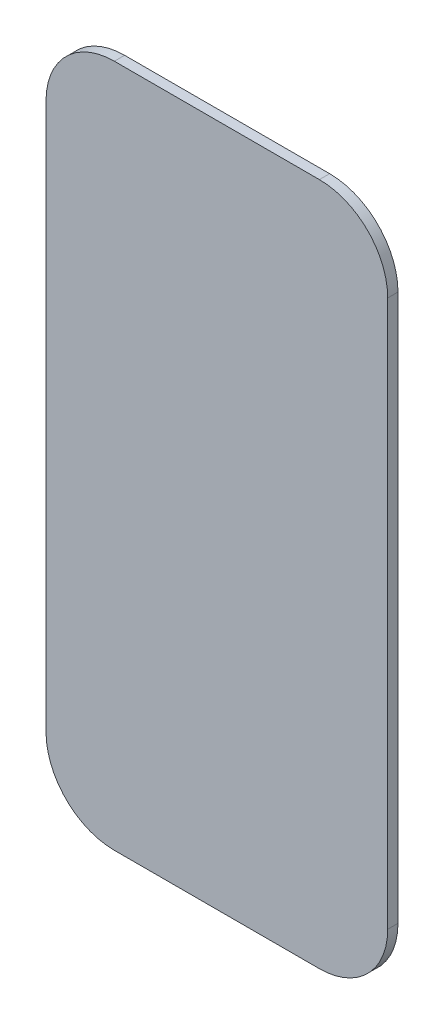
ISO-10303-21;
HEADER;
FILE_DESCRIPTION(('STEP AP214'),'2;1');
FILE_NAME('part.step','',(''),(''),'','','');
FILE_SCHEMA(('AUTOMOTIVE_DESIGN { 1 0 10303 214 1 1 1 1 }'));
ENDSEC;
DATA;
#1=APPLICATION_CONTEXT('core data for automotive mechanical design processes');
#2=APPLICATION_PROTOCOL_DEFINITION('international standard','automotive_design',2000,#1);
#3=PRODUCT_CONTEXT('',#1,'mechanical');
#4=PRODUCT('Part','Part','',(#3));
#5=PRODUCT_RELATED_PRODUCT_CATEGORY('part','',(#4));
#6=PRODUCT_DEFINITION_FORMATION('','',#4);
#7=PRODUCT_DEFINITION_CONTEXT('part definition',#1,'design');
#8=PRODUCT_DEFINITION('design','',#6,#7);
#9=PRODUCT_DEFINITION_SHAPE('','',#8);
#10=(LENGTH_UNIT() NAMED_UNIT(*) SI_UNIT(.MILLI.,.METRE.));
#11=(NAMED_UNIT(*) PLANE_ANGLE_UNIT() SI_UNIT($,.RADIAN.));
#12=(NAMED_UNIT(*) SI_UNIT($,.STERADIAN.) SOLID_ANGLE_UNIT());
#13=UNCERTAINTY_MEASURE_WITH_UNIT(LENGTH_MEASURE(1.E-05),#10,'distance_accuracy_value','');
#14=(GEOMETRIC_REPRESENTATION_CONTEXT(3) GLOBAL_UNCERTAINTY_ASSIGNED_CONTEXT((#13)) GLOBAL_UNIT_ASSIGNED_CONTEXT((#10,
#11,#12)) REPRESENTATION_CONTEXT('',''));
#15=CARTESIAN_POINT('',(0.,0.,0.));
#16=DIRECTION('',(0.,0.,1.));
#17=DIRECTION('',(1.,0.,0.));
#18=AXIS2_PLACEMENT_3D('',#15,#16,#17);
#19=CARTESIAN_POINT('',(-30.,-80.,3.));
#20=DIRECTION('',(0.,0.,-1.));
#21=DIRECTION('',(-1.,0.,0.));
#22=AXIS2_PLACEMENT_3D('',#19,#20,#21);
#23=CYLINDRICAL_SURFACE('',#22,20.);
#24=CARTESIAN_POINT('',(-30.,-80.,0.));
#25=DIRECTION('',(0.,0.,1.));
#26=DIRECTION('',(-1.,0.,0.));
#27=AXIS2_PLACEMENT_3D('',#24,#25,#26);
#28=CIRCLE('',#27,20.);
#29=CARTESIAN_POINT('',(-50.,-80.,0.));
#30=VERTEX_POINT('',#29);
#31=CARTESIAN_POINT('',(-30.,-100.,0.));
#32=VERTEX_POINT('',#31);
#33=EDGE_CURVE('E134',#30,#32,#28,.T.);
#34=ORIENTED_EDGE('',*,*,#33,.T.);
#35=DIRECTION('',(0.,0.,-1.));
#36=VECTOR('',#35,1.);
#37=CARTESIAN_POINT('',(-30.,-100.,3.));
#38=LINE('',#37,#36);
#39=CARTESIAN_POINT('',(-30.,-100.,3.));
#40=VERTEX_POINT('',#39);
#41=EDGE_CURVE('E11',#40,#32,#38,.T.);
#42=ORIENTED_EDGE('',*,*,#41,.F.);
#43=CARTESIAN_POINT('',(-30.,-80.,3.));
#44=DIRECTION('',(0.,0.,1.));
#45=DIRECTION('',(-1.,0.,0.));
#46=AXIS2_PLACEMENT_3D('',#43,#44,#45);
#47=CIRCLE('',#46,20.);
#48=CARTESIAN_POINT('',(-50.,-80.,3.));
#49=VERTEX_POINT('',#48);
#50=EDGE_CURVE('E148',#49,#40,#47,.T.);
#51=ORIENTED_EDGE('',*,*,#50,.F.);
#52=DIRECTION('',(0.,0.,-1.));
#53=VECTOR('',#52,1.);
#54=CARTESIAN_POINT('',(-50.,-80.,3.));
#55=LINE('',#54,#53);
#56=EDGE_CURVE('E130',#49,#30,#55,.T.);
#57=ORIENTED_EDGE('',*,*,#56,.T.);
#58=EDGE_LOOP('',(#34,#42,#51,#57));
#59=FACE_BOUND('',#58,.T.);
#60=ADVANCED_FACE('F38',(#59),#23,.T.);
#61=CARTESIAN_POINT('',(30.,-100.,3.));
#62=DIRECTION('',(0.,1.,0.));
#63=DIRECTION('',(-1.,0.,0.));
#64=AXIS2_PLACEMENT_3D('',#61,#62,#63);
#65=PLANE('',#64);
#66=DIRECTION('',(1.,0.,0.));
#67=VECTOR('',#66,1.);
#68=CARTESIAN_POINT('',(30.,-100.,0.));
#69=LINE('',#68,#67);
#70=CARTESIAN_POINT('',(30.,-100.,0.));
#71=VERTEX_POINT('',#70);
#72=EDGE_CURVE('E137',#32,#71,#69,.T.);
#73=ORIENTED_EDGE('',*,*,#72,.T.);
#74=DIRECTION('',(0.,0.,-1.));
#75=VECTOR('',#74,1.);
#76=CARTESIAN_POINT('',(30.,-100.,3.));
#77=LINE('',#76,#75);
#78=CARTESIAN_POINT('',(30.,-100.,3.));
#79=VERTEX_POINT('',#78);
#80=EDGE_CURVE('E46',#79,#71,#77,.T.);
#81=ORIENTED_EDGE('',*,*,#80,.F.);
#82=DIRECTION('',(1.,0.,0.));
#83=VECTOR('',#82,1.);
#84=CARTESIAN_POINT('',(30.,-100.,3.));
#85=LINE('',#84,#83);
#86=EDGE_CURVE('E97',#40,#79,#85,.T.);
#87=ORIENTED_EDGE('',*,*,#86,.F.);
#88=ORIENTED_EDGE('',*,*,#41,.T.);
#89=EDGE_LOOP('',(#73,#81,#87,#88));
#90=FACE_BOUND('',#89,.T.);
#91=ADVANCED_FACE('F183',(#90),#65,.F.);
#92=CARTESIAN_POINT('',(30.,-80.,3.));
#93=DIRECTION('',(0.,0.,-1.));
#94=DIRECTION('',(-1.,0.,0.));
#95=AXIS2_PLACEMENT_3D('',#92,#93,#94);
#96=CYLINDRICAL_SURFACE('',#95,20.);
#97=CARTESIAN_POINT('',(30.,-80.,0.));
#98=DIRECTION('',(0.,0.,1.));
#99=DIRECTION('',(1.,0.,0.));
#100=AXIS2_PLACEMENT_3D('',#97,#98,#99);
#101=CIRCLE('',#100,20.);
#102=CARTESIAN_POINT('',(50.,-80.,0.));
#103=VERTEX_POINT('',#102);
#104=EDGE_CURVE('E139',#71,#103,#101,.T.);
#105=ORIENTED_EDGE('',*,*,#104,.T.);
#106=DIRECTION('',(0.,0.,-1.));
#107=VECTOR('',#106,1.);
#108=CARTESIAN_POINT('',(50.,-80.,3.));
#109=LINE('',#108,#107);
#110=CARTESIAN_POINT('',(50.,-80.,3.));
#111=VERTEX_POINT('',#110);
#112=EDGE_CURVE('E155',#111,#103,#109,.T.);
#113=ORIENTED_EDGE('',*,*,#112,.F.);
#114=CARTESIAN_POINT('',(30.,-80.,3.));
#115=DIRECTION('',(0.,0.,1.));
#116=DIRECTION('',(1.,0.,0.));
#117=AXIS2_PLACEMENT_3D('',#114,#115,#116);
#118=CIRCLE('',#117,20.);
#119=EDGE_CURVE('E163',#79,#111,#118,.T.);
#120=ORIENTED_EDGE('',*,*,#119,.F.);
#121=ORIENTED_EDGE('',*,*,#80,.T.);
#122=EDGE_LOOP('',(#105,#113,#120,#121));
#123=FACE_BOUND('',#122,.T.);
#124=ADVANCED_FACE('F161',(#123),#96,.T.);
#125=CARTESIAN_POINT('',(50.,-80.,3.));
#126=DIRECTION('',(-1.,0.,0.));
#127=DIRECTION('',(0.,0.,1.));
#128=AXIS2_PLACEMENT_3D('',#125,#126,#127);
#129=PLANE('',#128);
#130=DIRECTION('',(0.,1.,0.));
#131=VECTOR('',#130,1.);
#132=CARTESIAN_POINT('',(50.,-80.,0.));
#133=LINE('',#132,#131);
#134=CARTESIAN_POINT('',(50.,80.,0.));
#135=VERTEX_POINT('',#134);
#136=EDGE_CURVE('E141',#103,#135,#133,.T.);
#137=ORIENTED_EDGE('',*,*,#136,.T.);
#138=DIRECTION('',(0.,0.,-1.));
#139=VECTOR('',#138,1.);
#140=CARTESIAN_POINT('',(50.,80.,3.));
#141=LINE('',#140,#139);
#142=CARTESIAN_POINT('',(50.,80.,3.));
#143=VERTEX_POINT('',#142);
#144=EDGE_CURVE('E152',#143,#135,#141,.T.);
#145=ORIENTED_EDGE('',*,*,#144,.F.);
#146=DIRECTION('',(0.,1.,0.));
#147=VECTOR('',#146,1.);
#148=CARTESIAN_POINT('',(50.,-80.,3.));
#149=LINE('',#148,#147);
#150=EDGE_CURVE('E175',#111,#143,#149,.T.);
#151=ORIENTED_EDGE('',*,*,#150,.F.);
#152=ORIENTED_EDGE('',*,*,#112,.T.);
#153=EDGE_LOOP('',(#137,#145,#151,#152));
#154=FACE_BOUND('',#153,.T.);
#155=ADVANCED_FACE('F171',(#154),#129,.F.);
#156=CARTESIAN_POINT('',(30.,80.,3.));
#157=DIRECTION('',(0.,0.,-1.));
#158=DIRECTION('',(-1.,0.,0.));
#159=AXIS2_PLACEMENT_3D('',#156,#157,#158);
#160=CYLINDRICAL_SURFACE('',#159,20.);
#161=CARTESIAN_POINT('',(30.,80.,0.));
#162=DIRECTION('',(0.,0.,1.));
#163=DIRECTION('',(1.,0.,0.));
#164=AXIS2_PLACEMENT_3D('',#161,#162,#163);
#165=CIRCLE('',#164,20.);
#166=CARTESIAN_POINT('',(30.,100.,0.));
#167=VERTEX_POINT('',#166);
#168=EDGE_CURVE('E143',#135,#167,#165,.T.);
#169=ORIENTED_EDGE('',*,*,#168,.T.);
#170=DIRECTION('',(0.,0.,-1.));
#171=VECTOR('',#170,1.);
#172=CARTESIAN_POINT('',(30.,100.,3.));
#173=LINE('',#172,#171);
#174=CARTESIAN_POINT('',(30.,100.,3.));
#175=VERTEX_POINT('',#174);
#176=EDGE_CURVE('E125',#175,#167,#173,.T.);
#177=ORIENTED_EDGE('',*,*,#176,.F.);
#178=CARTESIAN_POINT('',(30.,80.,3.));
#179=DIRECTION('',(0.,0.,1.));
#180=DIRECTION('',(1.,0.,0.));
#181=AXIS2_PLACEMENT_3D('',#178,#179,#180);
#182=CIRCLE('',#181,20.);
#183=EDGE_CURVE('E116',#143,#175,#182,.T.);
#184=ORIENTED_EDGE('',*,*,#183,.F.);
#185=ORIENTED_EDGE('',*,*,#144,.T.);
#186=EDGE_LOOP('',(#169,#177,#184,#185));
#187=FACE_BOUND('',#186,.T.);
#188=ADVANCED_FACE('F174',(#187),#160,.T.);
#189=CARTESIAN_POINT('',(30.,100.,3.));
#190=DIRECTION('',(0.,-1.,0.));
#191=DIRECTION('',(1.,0.,0.));
#192=AXIS2_PLACEMENT_3D('',#189,#190,#191);
#193=PLANE('',#192);
#194=DIRECTION('',(-1.,0.,0.));
#195=VECTOR('',#194,1.);
#196=CARTESIAN_POINT('',(30.,100.,0.));
#197=LINE('',#196,#195);
#198=CARTESIAN_POINT('',(-30.,100.,0.));
#199=VERTEX_POINT('',#198);
#200=EDGE_CURVE('E124',#167,#199,#197,.T.);
#201=ORIENTED_EDGE('',*,*,#200,.T.);
#202=DIRECTION('',(0.,0.,-1.));
#203=VECTOR('',#202,1.);
#204=CARTESIAN_POINT('',(-30.,100.,3.));
#205=LINE('',#204,#203);
#206=CARTESIAN_POINT('',(-30.,100.,3.));
#207=VERTEX_POINT('',#206);
#208=EDGE_CURVE('E121',#207,#199,#205,.T.);
#209=ORIENTED_EDGE('',*,*,#208,.F.);
#210=DIRECTION('',(-1.,0.,0.));
#211=VECTOR('',#210,1.);
#212=CARTESIAN_POINT('',(30.,100.,3.));
#213=LINE('',#212,#211);
#214=EDGE_CURVE('E110',#175,#207,#213,.T.);
#215=ORIENTED_EDGE('',*,*,#214,.F.);
#216=ORIENTED_EDGE('',*,*,#176,.T.);
#217=EDGE_LOOP('',(#201,#209,#215,#216));
#218=FACE_BOUND('',#217,.T.);
#219=ADVANCED_FACE('F122',(#218),#193,.F.);
#220=CARTESIAN_POINT('',(-30.,80.,3.));
#221=DIRECTION('',(0.,0.,-1.));
#222=DIRECTION('',(-1.,0.,0.));
#223=AXIS2_PLACEMENT_3D('',#220,#221,#222);
#224=CYLINDRICAL_SURFACE('',#223,20.);
#225=CARTESIAN_POINT('',(-30.,80.,0.));
#226=DIRECTION('',(0.,0.,1.));
#227=DIRECTION('',(1.,0.,0.));
#228=AXIS2_PLACEMENT_3D('',#225,#226,#227);
#229=CIRCLE('',#228,20.);
#230=CARTESIAN_POINT('',(-50.,80.,0.));
#231=VERTEX_POINT('',#230);
#232=EDGE_CURVE('E83',#199,#231,#229,.T.);
#233=ORIENTED_EDGE('',*,*,#232,.T.);
#234=DIRECTION('',(0.,0.,-1.));
#235=VECTOR('',#234,1.);
#236=CARTESIAN_POINT('',(-50.,80.,3.));
#237=LINE('',#236,#235);
#238=CARTESIAN_POINT('',(-50.,80.,3.));
#239=VERTEX_POINT('',#238);
#240=EDGE_CURVE('E126',#239,#231,#237,.T.);
#241=ORIENTED_EDGE('',*,*,#240,.F.);
#242=CARTESIAN_POINT('',(-30.,80.,3.));
#243=DIRECTION('',(0.,0.,1.));
#244=DIRECTION('',(1.,0.,0.));
#245=AXIS2_PLACEMENT_3D('',#242,#243,#244);
#246=CIRCLE('',#245,20.);
#247=EDGE_CURVE('E114',#207,#239,#246,.T.);
#248=ORIENTED_EDGE('',*,*,#247,.F.);
#249=ORIENTED_EDGE('',*,*,#208,.T.);
#250=EDGE_LOOP('',(#233,#241,#248,#249));
#251=FACE_BOUND('',#250,.T.);
#252=ADVANCED_FACE('F128',(#251),#224,.T.);
#253=CARTESIAN_POINT('',(-50.,-80.,3.));
#254=DIRECTION('',(1.,0.,0.));
#255=DIRECTION('',(0.,0.,-1.));
#256=AXIS2_PLACEMENT_3D('',#253,#254,#255);
#257=PLANE('',#256);
#258=DIRECTION('',(0.,-1.,0.));
#259=VECTOR('',#258,1.);
#260=CARTESIAN_POINT('',(-50.,-80.,0.));
#261=LINE('',#260,#259);
#262=EDGE_CURVE('E89',#231,#30,#261,.T.);
#263=ORIENTED_EDGE('',*,*,#262,.T.);
#264=ORIENTED_EDGE('',*,*,#56,.F.);
#265=DIRECTION('',(0.,-1.,0.));
#266=VECTOR('',#265,1.);
#267=CARTESIAN_POINT('',(-50.,-80.,3.));
#268=LINE('',#267,#266);
#269=EDGE_CURVE('E54',#239,#49,#268,.T.);
#270=ORIENTED_EDGE('',*,*,#269,.F.);
#271=ORIENTED_EDGE('',*,*,#240,.T.);
#272=EDGE_LOOP('',(#263,#264,#270,#271));
#273=FACE_BOUND('',#272,.T.);
#274=ADVANCED_FACE('F199',(#273),#257,.F.);
#275=CARTESIAN_POINT('',(-30.,-80.,3.));
#276=DIRECTION('',(0.,0.,-1.));
#277=DIRECTION('',(-1.,0.,0.));
#278=AXIS2_PLACEMENT_3D('',#275,#276,#277);
#279=PLANE('',#278);
#280=ORIENTED_EDGE('',*,*,#50,.T.);
#281=ORIENTED_EDGE('',*,*,#86,.T.);
#282=ORIENTED_EDGE('',*,*,#119,.T.);
#283=ORIENTED_EDGE('',*,*,#150,.T.);
#284=ORIENTED_EDGE('',*,*,#183,.T.);
#285=ORIENTED_EDGE('',*,*,#214,.T.);
#286=ORIENTED_EDGE('',*,*,#247,.T.);
#287=ORIENTED_EDGE('',*,*,#269,.T.);
#288=EDGE_LOOP('',(#280,#281,#282,#283,#284,#285,#286,#287));
#289=FACE_BOUND('',#288,.T.);
#290=ADVANCED_FACE('F112',(#289),#279,.F.);
#291=CARTESIAN_POINT('',(-30.,-80.,0.));
#292=DIRECTION('',(0.,0.,-1.));
#293=DIRECTION('',(-1.,0.,0.));
#294=AXIS2_PLACEMENT_3D('',#291,#292,#293);
#295=PLANE('',#294);
#296=ORIENTED_EDGE('',*,*,#33,.F.);
#297=ORIENTED_EDGE('',*,*,#262,.F.);
#298=ORIENTED_EDGE('',*,*,#232,.F.);
#299=ORIENTED_EDGE('',*,*,#200,.F.);
#300=ORIENTED_EDGE('',*,*,#168,.F.);
#301=ORIENTED_EDGE('',*,*,#136,.F.);
#302=ORIENTED_EDGE('',*,*,#104,.F.);
#303=ORIENTED_EDGE('',*,*,#72,.F.);
#304=EDGE_LOOP('',(#296,#297,#298,#299,#300,#301,#302,#303));
#305=FACE_BOUND('',#304,.T.);
#306=ADVANCED_FACE('F167',(#305),#295,.T.);
#307=CLOSED_SHELL('',(#60,#91,#124,#155,#188,#219,#252,#274,#290,#306));
#308=MANIFOLD_SOLID_BREP('B2',#307);
#309=ADVANCED_BREP_SHAPE_REPRESENTATION('',(#18,#308),#14);
#310=SHAPE_DEFINITION_REPRESENTATION(#9,#309);
ENDSEC;
END-ISO-10303-21;
